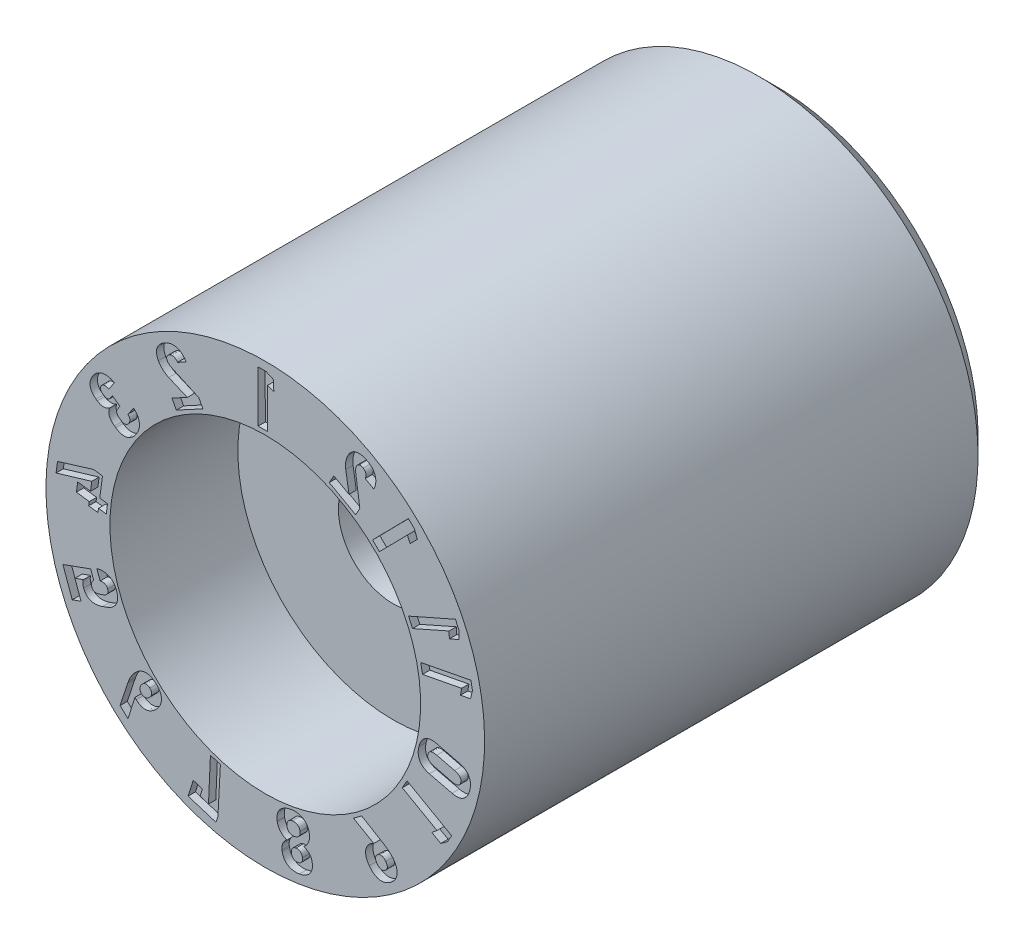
from build123d import *

# Parameters (mm, degrees)
CUT_EXTRUDE1_DEPTH = 0.2


with BuildPart() as part:
    # Sketch1 → Revolve1 (revolve)
    with BuildSketch(Plane(origin=(0, 0, 0), x_dir=(0, 0, -1), z_dir=(1, 0, 0)), mode=Mode.PRIVATE) as revolve1_sk:
        Polygon((14, 1.5), (14, 5.5), (13.5, 6), (0, 6), (0, 4.25), (3.5, 4.25), (3.5, 1.5), align=None)
    revolve(revolve1_sk.sketch.rotate(Axis((0, 0, 0), (0, 0, -1)), 180), axis=Axis((0, 0, 0), (0, 0, -1)))

    # Sketch2 → Cut-Extrude1 (cut)
    # profile 1 of 15: a face of its own
    with BuildSketch(Plane.XY):
        Polygon((-0.197789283, 4.361647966), (0.066563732, 4.363172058), (0.060734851, 5.45638428), (0.232188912, 5.392327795), (0.230736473, 5.673574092), (0.020579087, 5.766859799), (-0.20515278, 5.765581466), align=None)
    # profile 2 of 15: a face of its own
    with BuildSketch(Plane.XY):
        with BuildLine():
            Line((-1.818293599, 4.226114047), (-2.540496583, 4.55327584))
            add(Edge.make_bspline(
                [(-2.540496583, 4.55327584), (-2.570849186, 4.567228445), (-2.607531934, 4.587861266), (-2.643392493, 4.620897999), (-2.66313812, 4.641625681), (-2.675061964, 4.658815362), (-2.681524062, 4.670623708)],
                knots=[0, 0, 0, 0, 0.540031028, 0.66553244, 0.783527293, 1, 1, 1, 1], degree=3))
            Line((-2.681524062, 4.670623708), (-2.682483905, 4.672279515))
            add(Edge.make_bspline(
                [(-2.682483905, 4.672279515), (-2.691000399, 4.687155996), (-2.699210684, 4.711252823), (-2.698842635, 4.744176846), (-2.692586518, 4.767175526), (-2.680864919, 4.788954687), (-2.657016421, 4.817386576), (-2.632502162, 4.833373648), (-2.614935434, 4.842989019)],
                knots=[0, 0, 0, 0, 0.246786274, 0.356909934, 0.46944845, 0.586307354, 0.710253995, 1, 1, 1, 1], degree=3))
            add(Edge.make_bspline(
                [(-2.614935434, 4.842989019), (-2.597313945, 4.85241795), (-2.568802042, 4.862517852), (-2.529364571, 4.862700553), (-2.500878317, 4.856309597), (-2.47339714, 4.843926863), (-2.436703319, 4.81861036), (-2.414141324, 4.791924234), (-2.400526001, 4.772308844)],
                knots=[0, 0, 0, 0, 0.240300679, 0.353786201, 0.468512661, 0.587496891, 0.71289196, 1, 1, 1, 1], degree=3))
            Line((-2.400526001, 4.772308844), (-2.400124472, 4.771361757))
            Line((-2.400124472, 4.771361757), (-2.162339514, 4.899762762))
            Line((-2.162339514, 4.899762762), (-2.162741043, 4.900709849))
            add(Edge.make_bspline(
                [(-2.162741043, 4.900709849), (-2.184602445, 4.935428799), (-2.221196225, 4.983520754), (-2.278910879, 5.036863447), (-2.323937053, 5.068901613), (-2.371113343, 5.094233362), (-2.420103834, 5.112587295), (-2.470846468, 5.122937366), (-2.522762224, 5.126556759), (-2.575604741, 5.122918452), (-2.647953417, 5.107258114), (-2.700403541, 5.085897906), (-2.733995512, 5.067458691)],
                knots=[0, 0, 0, 0, 0.185247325, 0.270908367, 0.35379884, 0.433963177, 0.511943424, 0.589014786, 0.666847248, 0.746166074, 0.827198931, 1, 1, 1, 1], degree=3))
            add(Edge.make_bspline(
                [(-2.733995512, 5.067458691), (-2.769634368, 5.048059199), (-2.819604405, 5.015973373), (-2.876537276, 4.964598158), (-2.910766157, 4.924674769), (-2.938201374, 4.882841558), (-2.958403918, 4.839047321), (-2.971663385, 4.793560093), (-2.976863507, 4.746392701), (-2.975338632, 4.698075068), (-2.962100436, 4.630645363), (-2.941815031, 4.581759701), (-2.924660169, 4.550181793)],
                knots=[0, 0, 0, 0, 0.194582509, 0.283014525, 0.366623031, 0.445927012, 0.521986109, 0.596944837, 0.671952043, 0.748457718, 0.827747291, 1, 1, 1, 1], degree=3))
            Line((-2.924660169, 4.550181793), (-2.92425864, 4.549234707))
            add(Edge.make_bspline(
                [(-2.92425864, 4.549234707), (-2.908886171, 4.521411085), (-2.882739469, 4.480982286), (-2.840349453, 4.432515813), (-2.805656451, 4.398035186), (-2.768167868, 4.366461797), (-2.715035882, 4.329496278), (-2.672571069, 4.306223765), (-2.643023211, 4.293564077)],
                knots=[0, 0, 0, 0, 0.24663637, 0.371530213, 0.498650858, 0.625608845, 0.751024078, 1, 1, 1, 1], degree=3))
            Line((-2.643023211, 4.293564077), (-2.133326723, 4.074760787))
            Line((-2.133326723, 4.074760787), (-2.554003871, 3.847419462))
            Line((-2.554003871, 3.847419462), (-2.433287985, 3.623909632))
            Line((-2.433287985, 3.623909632), (-1.705501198, 4.01703613))
            Line((-1.705501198, 4.01703613), (-1.818293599, 4.226114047))
        make_face()
    # profile 3 of 15: a face of its own
    with BuildSketch(Plane.XY):
        with BuildLine():
            Line((-3.602387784, 3.083039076), (-3.758433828, 2.861259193))
            add(Edge.make_bspline(
                [(-3.758433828, 2.861259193), (-3.748419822, 2.851976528), (-3.734779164, 2.837146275), (-3.720584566, 2.815148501), (-3.712343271, 2.798664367), (-3.707009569, 2.781734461), (-3.703533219, 2.764720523), (-3.702578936, 2.747563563), (-3.703624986, 2.730286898), (-3.707248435, 2.713207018), (-3.715443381, 2.690115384), (-3.724594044, 2.673726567), (-3.732029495, 2.663347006)],
                knots=[0, 0, 0, 0, 0.185668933, 0.271849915, 0.355025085, 0.435165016, 0.512269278, 0.590352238, 0.667877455, 0.746757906, 0.826657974, 1, 1, 1, 1], degree=3))
            add(Edge.make_bspline(
                [(-3.732029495, 2.663347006), (-3.744748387, 2.644964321), (-3.766927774, 2.620306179), (-3.804025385, 2.599855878), (-3.832434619, 2.591770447), (-3.862139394, 2.59033721), (-3.904294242, 2.598172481), (-3.933667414, 2.614184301), (-3.952177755, 2.627114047)],
                knots=[0, 0, 0, 0, 0.265738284, 0.383017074, 0.496928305, 0.612242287, 0.731702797, 1, 1, 1, 1], degree=3))
            Line((-3.952177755, 2.627114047), (-3.978885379, 2.645696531))
            add(Edge.make_bspline(
                [(-3.978885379, 2.645696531), (-3.998098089, 2.659463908), (-4.024807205, 2.681161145), (-4.049615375, 2.716775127), (-4.060927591, 2.742705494), (-4.066432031, 2.769009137), (-4.063886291, 2.805254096), (-4.052075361, 2.830574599), (-4.041164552, 2.845546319)],
                knots=[0, 0, 0, 0, 0.300575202, 0.428718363, 0.545675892, 0.65647807, 0.76535517, 1, 1, 1, 1], degree=3))
            Line((-4.041164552, 2.845546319), (-3.973447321, 2.942110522))
            Line((-3.973447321, 2.942110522), (-4.180536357, 3.087679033))
            Line((-4.180536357, 3.087679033), (-4.248253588, 2.991114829))
            add(Edge.make_bspline(
                [(-4.248253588, 2.991114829), (-4.256623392, 2.978356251), (-4.273519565, 2.962758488), (-4.301382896, 2.951229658), (-4.324119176, 2.948536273), (-4.348413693, 2.951155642), (-4.384258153, 2.961641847), (-4.409757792, 2.976563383), (-4.426423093, 2.988197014)],
                knots=[0, 0, 0, 0, 0.22677833, 0.333313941, 0.445234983, 0.564594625, 0.695766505, 1, 1, 1, 1], degree=3))
            Line((-4.426423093, 2.988197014), (-4.445613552, 3.00190584))
            add(Edge.make_bspline(
                [(-4.445613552, 3.00190584), (-4.461191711, 3.013062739), (-4.482773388, 3.031063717), (-4.501989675, 3.061032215), (-4.510478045, 3.083242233), (-4.513410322, 3.106046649), (-4.51020609, 3.137724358), (-4.499075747, 3.159863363), (-4.489429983, 3.173228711)],
                knots=[0, 0, 0, 0, 0.288124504, 0.41192529, 0.528488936, 0.640572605, 0.752466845, 1, 1, 1, 1], degree=3))
            add(Edge.make_bspline(
                [(-4.489429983, 3.173228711), (-4.482824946, 3.182610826), (-4.47134178, 3.195685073), (-4.452365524, 3.208401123), (-4.437372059, 3.216498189), (-4.420836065, 3.221796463), (-4.403482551, 3.225991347), (-4.384892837, 3.226740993), (-4.365536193, 3.226285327), (-4.345341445, 3.223375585), (-4.316510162, 3.216628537), (-4.295258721, 3.208021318), (-4.281005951, 3.201599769)],
                knots=[0, 0, 0, 0, 0.150327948, 0.223514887, 0.297445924, 0.371958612, 0.449582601, 0.529747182, 0.613908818, 0.702218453, 0.795553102, 1, 1, 1, 1], degree=3))
            Line((-4.281005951, 3.201599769), (-4.125668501, 3.422821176))
            add(Edge.make_bspline(
                [(-4.125668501, 3.422821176), (-4.160671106, 3.442797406), (-4.214726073, 3.467958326), (-4.289921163, 3.487213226), (-4.344493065, 3.494145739), (-4.397880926, 3.493985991), (-4.44973917, 3.487595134), (-4.499414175, 3.473469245), (-4.546846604, 3.452966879), (-4.591674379, 3.426546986), (-4.647732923, 3.382744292), (-4.683195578, 3.341933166), (-4.703851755, 3.312213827)],
                knots=[0, 0, 0, 0, 0.185402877, 0.271954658, 0.355808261, 0.437510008, 0.51672484, 0.595164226, 0.673981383, 0.753613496, 0.833638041, 1, 1, 1, 1], degree=3))
            add(Edge.make_bspline(
                [(-4.703851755, 3.312213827), (-4.720542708, 3.288235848), (-4.743205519, 3.251896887), (-4.766447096, 3.201469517), (-4.779391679, 3.165075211), (-4.788296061, 3.12902815), (-4.793555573, 3.093395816), (-4.794670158, 3.058203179), (-4.791569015, 3.023659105), (-4.784971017, 2.989853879), (-4.774390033, 2.957116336), (-4.759859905, 2.925537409), (-4.741663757, 2.895005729), (-4.719101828, 2.866075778), (-4.683560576, 2.827708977), (-4.652078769, 2.802617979), (-4.629793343, 2.786671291)],
                knots=[0, 0, 0, 0, 0.145221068, 0.21203939, 0.275497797, 0.336822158, 0.396212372, 0.454116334, 0.511300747, 0.568162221, 0.624888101, 0.681779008, 0.74052302, 0.801035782, 0.86369242, 1, 1, 1, 1], degree=3))
            Line((-4.629793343, 2.786671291), (-4.595278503, 2.762409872))
            add(Edge.make_bspline(
                [(-4.595278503, 2.762409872), (-4.570307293, 2.745071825), (-4.53033843, 2.723037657), (-4.472476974, 2.708670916), (-4.429300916, 2.704263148), (-4.385954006, 2.707139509), (-4.327635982, 2.720146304), (-4.286804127, 2.740831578), (-4.261153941, 2.757514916)],
                knots=[0, 0, 0, 0, 0.256538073, 0.378140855, 0.499461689, 0.620240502, 0.742003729, 1, 1, 1, 1], degree=3))
            add(Edge.make_bspline(
                [(-4.261153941, 2.757514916), (-4.267756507, 2.742273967), (-4.274899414, 2.718563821), (-4.280034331, 2.686390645), (-4.282001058, 2.662679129), (-4.281102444, 2.639059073), (-4.277721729, 2.615662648), (-4.272429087, 2.592216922), (-4.264612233, 2.569034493), (-4.254562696, 2.54616059), (-4.242205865, 2.523970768), (-4.228087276, 2.50223551), (-4.211524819, 2.481292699), (-4.192991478, 2.460766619), (-4.164606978, 2.433782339), (-4.140802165, 2.415630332), (-4.124340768, 2.403774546)],
                knots=[0, 0, 0, 0, 0.120514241, 0.178963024, 0.236485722, 0.293075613, 0.350257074, 0.408015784, 0.467448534, 0.527698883, 0.589261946, 0.6517676, 0.715782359, 0.78301219, 0.852531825, 1, 1, 1, 1], degree=3))
            Line((-4.124340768, 2.403774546), (-4.089825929, 2.379513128))
            add(Edge.make_bspline(
                [(-4.089825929, 2.379513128), (-4.058900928, 2.35757636), (-4.010446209, 2.32984393), (-3.941973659, 2.306958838), (-3.892460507, 2.29774944), (-3.843513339, 2.295847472), (-3.795487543, 2.30232439), (-3.748439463, 2.315845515), (-3.702745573, 2.337049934), (-3.658621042, 2.36565371), (-3.600551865, 2.414963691), (-3.56291886, 2.460411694), (-3.53978661, 2.493326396)],
                knots=[0, 0, 0, 0, 0.178207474, 0.259966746, 0.33803101, 0.414007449, 0.489004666, 0.564650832, 0.643103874, 0.724692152, 0.81089971, 1, 1, 1, 1], degree=3))
            add(Edge.make_bspline(
                [(-3.53978661, 2.493326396), (-3.516564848, 2.526033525), (-3.486909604, 2.577342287), (-3.459961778, 2.649890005), (-3.447043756, 2.70338819), (-3.440678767, 2.756651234), (-3.442254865, 2.809165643), (-3.450606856, 2.860598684), (-3.466173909, 2.910750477), (-3.489294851, 2.958707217), (-3.530787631, 3.020332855), (-3.572153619, 3.059472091), (-3.602387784, 3.083039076)],
                knots=[0, 0, 0, 0, 0.181513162, 0.266410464, 0.349351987, 0.429979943, 0.508354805, 0.586249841, 0.66506638, 0.74508699, 0.826277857, 1, 1, 1, 1], degree=3))
        make_face()
    # profile 4 of 15: a face of its own
    with BuildSketch(Plane.XY):
        Polygon((-4.69377454, 1.085606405), (-5.68439717, 0.783595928), (-5.724131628, 0.487990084), (-4.746612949, 0.779988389), (-4.780502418, 0.527004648), (-5.131814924, 0.574197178), (-5.166887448, 0.312815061), (-4.815517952, 0.265614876), (-4.830064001, 0.157029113), (-4.578413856, 0.123149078), (-4.563824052, 0.231804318), (-4.350243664, 0.203113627), (-4.31517114, 0.464495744), (-4.528727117, 0.493183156), (-4.453507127, 1.053372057), align=None)
    # profile 5 of 15: a face of its own
    with BuildSketch(Plane.XY):
        with BuildLine():
            Line((-4.607096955, -1.217617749), (-4.51827577, -1.467169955))
            add(Edge.make_bspline(
                [(-4.51827577, -1.467169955), (-4.494689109, -1.460592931), (-4.460693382, -1.456420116), (-4.416873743, -1.46065281), (-4.388272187, -1.469579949), (-4.362841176, -1.483266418), (-4.334063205, -1.509184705), (-4.319061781, -1.534600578), (-4.312754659, -1.553269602)],
                knots=[0, 0, 0, 0, 0.286425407, 0.412421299, 0.532755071, 0.648554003, 0.760968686, 1, 1, 1, 1], degree=3))
            add(Edge.make_bspline(
                [(-4.312754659, -1.553269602), (-4.305579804, -1.572893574), (-4.299449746, -1.603801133), (-4.306280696, -1.643855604), (-4.318395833, -1.67074686), (-4.336852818, -1.69504319), (-4.370910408, -1.725742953), (-4.404185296, -1.740282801), (-4.427112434, -1.749173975)],
                knots=[0, 0, 0, 0, 0.244767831, 0.357262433, 0.468878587, 0.585370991, 0.710838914, 1, 1, 1, 1], degree=3))
            Line((-4.427112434, -1.749173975), (-4.537982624, -1.789149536))
            add(Edge.make_bspline(
                [(-4.537982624, -1.789149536), (-4.561091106, -1.797817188), (-4.595556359, -1.806431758), (-4.640640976, -1.807093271), (-4.669461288, -1.801238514), (-4.694992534, -1.790409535), (-4.724252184, -1.767548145), (-4.738164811, -1.742616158), (-4.744610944, -1.725035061)],
                knots=[0, 0, 0, 0, 0.302892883, 0.431392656, 0.550040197, 0.661203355, 0.768793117, 1, 1, 1, 1], degree=3))
            add(Edge.make_bspline(
                [(-4.744610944, -1.725035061), (-4.750667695, -1.708295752), (-4.75664625, -1.682503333), (-4.755943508, -1.647980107), (-4.751158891, -1.623693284), (-4.742372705, -1.600678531), (-4.725203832, -1.571910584), (-4.706760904, -1.554097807), (-4.692912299, -1.544165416)],
                knots=[0, 0, 0, 0, 0.263348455, 0.385871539, 0.507659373, 0.627206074, 0.748082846, 1, 1, 1, 1], degree=3))
            Line((-4.692912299, -1.544165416), (-4.776675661, -1.311518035))
            Line((-4.776675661, -1.311518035), (-5.53654919, -1.585006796))
            Line((-5.53654919, -1.585006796), (-5.280941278, -2.2949181))
            Line((-5.280941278, -2.2949181), (-5.040936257, -2.20841889))
            Line((-5.040936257, -2.20841889), (-5.206881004, -1.747735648))
            Line((-5.206881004, -1.747735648), (-4.973391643, -1.663648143))
            add(Edge.make_bspline(
                [(-4.973391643, -1.663648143), (-4.979449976, -1.677003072), (-4.985461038, -1.699039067), (-4.988961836, -1.730295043), (-4.989084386, -1.756109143), (-4.987249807, -1.782562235), (-4.982293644, -1.817197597), (-4.975641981, -1.84237532), (-4.969897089, -1.858556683)],
                knots=[0, 0, 0, 0, 0.220311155, 0.341953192, 0.473174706, 0.6088078, 0.74130697, 1, 1, 1, 1], degree=3))
            add(Edge.make_bspline(
                [(-4.969897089, -1.858556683), (-4.958581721, -1.890697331), (-4.936219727, -1.935901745), (-4.894949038, -1.986898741), (-4.86019654, -2.018287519), (-4.821134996, -2.04359536), (-4.77784778, -2.062244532), (-4.730774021, -2.074384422), (-4.680004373, -2.080094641), (-4.626069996, -2.079481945), (-4.54731013, -2.069520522), (-4.488148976, -2.052524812), (-4.448319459, -2.038377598)],
                knots=[0, 0, 0, 0, 0.163572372, 0.239328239, 0.313612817, 0.387362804, 0.461652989, 0.538788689, 0.619799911, 0.706109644, 0.797006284, 1, 1, 1, 1], degree=3))
            Line((-4.448319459, -2.038377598), (-4.337449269, -1.998402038))
            add(Edge.make_bspline(
                [(-4.337449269, -1.998402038), (-4.297444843, -1.984455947), (-4.241320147, -1.958171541), (-4.175239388, -1.912692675), (-4.134539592, -1.874994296), (-4.100554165, -1.833931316), (-4.074147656, -1.789239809), (-4.054609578, -1.741444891), (-4.042923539, -1.690305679), (-4.038683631, -1.63640926), (-4.043106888, -1.558858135), (-4.058987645, -1.500906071), (-4.072323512, -1.462352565)],
                knots=[0, 0, 0, 0, 0.186940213, 0.272022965, 0.353192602, 0.431092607, 0.506534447, 0.581498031, 0.658173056, 0.737158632, 0.819460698, 1, 1, 1, 1], degree=3))
            add(Edge.make_bspline(
                [(-4.072323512, -1.462352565), (-4.084046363, -1.428129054), (-4.108525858, -1.380361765), (-4.150649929, -1.323582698), (-4.187145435, -1.287095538), (-4.22800539, -1.255919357), (-4.272899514, -1.230866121), (-4.321556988, -1.21178423), (-4.373827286, -1.199378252), (-4.429157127, -1.193558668), (-4.50807175, -1.194675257), (-4.567620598, -1.206304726), (-4.607096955, -1.217617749)],
                knots=[0, 0, 0, 0, 0.165262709, 0.244174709, 0.322923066, 0.400784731, 0.478837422, 0.557608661, 0.639405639, 0.724105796, 0.81178613, 1, 1, 1, 1], degree=3))
        make_face()
    # profile 6 of 15: a face of its own
    with BuildSketch(Plane.XY):
        with BuildLine():
            Line((-3.764542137, -3.514787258), (-3.973189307, -4.145807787))
            Line((-3.973189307, -4.145807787), (-3.756859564, -4.350843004))
            Line((-3.756859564, -4.350843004), (-3.563809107, -3.74675713))
            add(Edge.make_bspline(
                [(-3.563809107, -3.74675713), (-3.553912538, -3.760667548), (-3.542386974, -3.773421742), (-3.530054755, -3.785180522)],
                knots=[0.758677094, 0.758677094, 0.758677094, 0.758677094, 1, 1, 1, 1], degree=3))
            add(Edge.make_bspline(
                [(-3.530054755, -3.785180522), (-3.504116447, -3.810114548), (-3.462168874, -3.842372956), (-3.400317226, -3.872136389), (-3.354127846, -3.886167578), (-3.307071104, -3.893270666), (-3.259481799, -3.892038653), (-3.211645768, -3.883894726), (-3.163902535, -3.867946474), (-3.116204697, -3.845175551), (-3.051660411, -3.802910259), (-3.006841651, -3.763437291), (-2.97904452, -3.733339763)],
                knots=[0, 0, 0, 0, 0.171862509, 0.250291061, 0.32656686, 0.401554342, 0.47651707, 0.552895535, 0.632432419, 0.716093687, 0.80458129, 1, 1, 1, 1], degree=3))
            add(Edge.make_bspline(
                [(-2.97904452, -3.733339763), (-2.949407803, -3.70265089), (-2.911219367, -3.654584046), (-2.873337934, -3.584851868), (-2.853668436, -3.533537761), (-2.841710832, -3.48208586), (-2.837873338, -3.430719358), (-2.842197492, -3.379737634), (-2.854674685, -3.329455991), (-2.874821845, -3.280092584), (-2.913306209, -3.213972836), (-2.952234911, -3.169466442), (-2.981510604, -3.141840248)],
                knots=[0, 0, 0, 0, 0.186979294, 0.272364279, 0.353583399, 0.431716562, 0.507485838, 0.58271972, 0.659285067, 0.738013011, 0.8200875, 1, 1, 1, 1], degree=3))
            add(Edge.make_bspline(
                [(-2.981510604, -3.141840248), (-3.010547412, -3.114279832), (-3.056750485, -3.077770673), (-3.124443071, -3.042537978), (-3.174663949, -3.024845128), (-3.225347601, -3.015259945), (-3.276114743, -3.013428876), (-3.32684216, -3.019567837), (-3.377392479, -3.033346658), (-3.427127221, -3.055386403), (-3.49432846, -3.096164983), (-3.5394467, -3.137030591), (-3.568153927, -3.166914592)],
                knots=[0, 0, 0, 0, 0.180127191, 0.262705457, 0.342107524, 0.418644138, 0.493745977, 0.569602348, 0.647518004, 0.728441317, 0.813380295, 1, 1, 1, 1], degree=3))
            add(Edge.make_bspline(
                [(-3.568153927, -3.166914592), (-3.586760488, -3.186400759), (-3.612178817, -3.217109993), (-3.643344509, -3.261133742), (-3.690178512, -3.334663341), (-3.721798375, -3.40139848), (-3.743486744, -3.456589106)],
                knots=[0, 0, 0, 0, 0.230619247, 0.351394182, 0.476038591, 1, 1, 1, 1], degree=3))
            add(Edge.make_bspline(
                [(-3.743486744, -3.456589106), (-3.74731118, -3.46628495), (-3.75533677, -3.485330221), (-3.761194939, -3.505146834), (-3.764542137, -3.514787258)],
                knots=[0, 0, 0, 0, 0.505360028, 1, 1, 1, 1], degree=3))
        make_face()
        with BuildLine():
            Line((-3.157954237, -3.539554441), (-3.158765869, -3.540452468))
            add(Edge.make_bspline(
                [(-3.158765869, -3.540452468), (-3.176638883, -3.558829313), (-3.204363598, -3.583698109), (-3.246842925, -3.604345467), (-3.277068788, -3.611799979), (-3.306991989, -3.612257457), (-3.346933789, -3.602970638), (-3.37307914, -3.58481069), (-3.388363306, -3.570337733)],
                knots=[0, 0, 0, 0, 0.294328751, 0.419071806, 0.536316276, 0.647265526, 0.758044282, 1, 1, 1, 1], degree=3))
            add(Edge.make_bspline(
                [(-3.388363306, -3.570337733), (-3.404108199, -3.556308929), (-3.422291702, -3.53070194), (-3.434012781, -3.491521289), (-3.434297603, -3.461407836), (-3.427841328, -3.430715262), (-3.409420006, -3.387201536), (-3.386427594, -3.357942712), (-3.368895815, -3.339389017)],
                knots=[0, 0, 0, 0, 0.240144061, 0.350681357, 0.462748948, 0.580659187, 0.707140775, 1, 1, 1, 1], degree=3))
            add(Edge.make_bspline(
                [(-3.368895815, -3.339389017), (-3.353025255, -3.322585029), (-3.327989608, -3.301635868), (-3.289870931, -3.285036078), (-3.262011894, -3.279969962), (-3.234215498, -3.28202118), (-3.196054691, -3.292782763), (-3.171434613, -3.311909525), (-3.156187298, -3.325783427)],
                knots=[0, 0, 0, 0, 0.277582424, 0.398175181, 0.512354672, 0.625221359, 0.741294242, 1, 1, 1, 1], degree=3))
            add(Edge.make_bspline(
                [(-3.156187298, -3.325783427), (-3.140901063, -3.340160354), (-3.121101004, -3.364223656), (-3.10753132, -3.40179025), (-3.10477251, -3.429752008), (-3.108326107, -3.458026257), (-3.12243896, -3.497446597), (-3.142679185, -3.523337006), (-3.157954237, -3.539554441)],
                knots=[0, 0, 0, 0, 0.260003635, 0.375027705, 0.487763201, 0.603252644, 0.723685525, 1, 1, 1, 1], degree=3))
        make_face(mode=Mode.SUBTRACT)
    # profile 7 of 15: a face of its own
    with BuildSketch(Plane.XY):
        Polygon((-1.295226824, -5.433053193), (-1.227797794, -4.170593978), (-1.500745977, -4.085051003), (-1.553577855, -5.269311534), (-1.782967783, -5.197139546), (-1.71995233, -4.99580703), (-1.971834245, -4.916973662), (-2.11102816, -5.360906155), (-1.347689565, -5.600343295), align=None)
    # profile 8 of 15: a face of its own
    with BuildSketch(Plane.XY):
        with BuildLine():
            Line((0.325136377, -4.725408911), (0.328907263, -4.748223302))
            add(Edge.make_bspline(
                [(0.328907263, -4.748223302), (0.334365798, -4.782241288), (0.349955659, -4.832237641), (0.384694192, -4.892895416), (0.417183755, -4.93510184), (0.455059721, -4.97277418), (0.511366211, -5.015529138), (0.559969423, -5.037223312), (0.593478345, -5.047470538)],
                knots=[0, 0, 0, 0, 0.245718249, 0.369513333, 0.497226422, 0.624713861, 0.74971991, 1, 1, 1, 1], degree=3))
            add(Edge.make_bspline(
                [(0.593478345, -5.047470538), (0.569198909, -5.064943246), (0.535516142, -5.095219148), (0.500680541, -5.143899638), (0.479537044, -5.183094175), (0.464333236, -5.224256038), (0.451735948, -5.279896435), (0.452639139, -5.32264326), (0.457022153, -5.350234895)],
                knots=[0, 0, 0, 0, 0.257021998, 0.384551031, 0.51217146, 0.63812076, 0.76004896, 1, 1, 1, 1], degree=3))
            Line((0.457022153, -5.350234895), (0.462910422, -5.386485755))
            add(Edge.make_bspline(
                [(0.462910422, -5.386485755), (0.46865663, -5.420749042), (0.482465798, -5.470934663), (0.515050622, -5.530550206), (0.544225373, -5.570298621), (0.579326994, -5.604306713), (0.618470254, -5.633868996), (0.662705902, -5.656971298), (0.71070847, -5.674990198), (0.762480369, -5.686783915), (0.83743033, -5.69389648), (0.895126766, -5.689874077), (0.93381258, -5.683369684)],
                knots=[0, 0, 0, 0, 0.166755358, 0.246297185, 0.32438274, 0.402008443, 0.479602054, 0.55855855, 0.640168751, 0.724632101, 0.812104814, 1, 1, 1, 1], degree=3))
            add(Edge.make_bspline(
                [(0.93381258, -5.683369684), (0.972381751, -5.67667099), (1.028688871, -5.663022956), (1.097201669, -5.631673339), (1.142530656, -5.603915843), (1.182236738, -5.571397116), (1.21683184, -5.535558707), (1.244571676, -5.495201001), (1.266605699, -5.451593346), (1.281758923, -5.404753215), (1.293740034, -5.337870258), (1.290833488, -5.285968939), (1.285133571, -5.25163322)],
                knots=[0, 0, 0, 0, 0.187908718, 0.275416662, 0.360083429, 0.441840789, 0.520724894, 0.597915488, 0.675567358, 0.754033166, 0.832947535, 1, 1, 1, 1], degree=3))
            Line((1.285133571, -5.25163322), (1.279245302, -5.21538236))
            add(Edge.make_bspline(
                [(1.279245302, -5.21538236), (1.274671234, -5.187306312), (1.261360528, -5.146180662), (1.231257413, -5.096976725), (1.202893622, -5.063229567), (1.170302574, -5.032782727), (1.121160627, -4.998349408), (1.079460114, -4.980611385), (1.050489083, -4.972411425)],
                knots=[0, 0, 0, 0, 0.242452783, 0.36386828, 0.489952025, 0.617354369, 0.743250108, 1, 1, 1, 1], degree=3))
            add(Edge.make_bspline(
                [(1.050489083, -4.972411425), (1.079647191, -4.952118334), (1.118403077, -4.915207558), (1.159048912, -4.856850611), (1.182939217, -4.809026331), (1.200967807, -4.758904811), (1.2146699, -4.690279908), (1.213882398, -4.637881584), (1.208120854, -4.603808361)],
                knots=[0, 0, 0, 0, 0.252158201, 0.376883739, 0.504107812, 0.63129592, 0.754621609, 1, 1, 1, 1], degree=3))
            Line((1.208120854, -4.603808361), (1.204349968, -4.58099397))
            add(Edge.make_bspline(
                [(1.204349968, -4.58099397), (1.19807011, -4.544626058), (1.183740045, -4.491346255), (1.149035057, -4.428167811), (1.117860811, -4.386409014), (1.080966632, -4.349871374), (1.038800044, -4.319305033), (0.991719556, -4.294667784), (0.940132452, -4.27631133), (0.884744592, -4.263930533), (0.80453475, -4.256434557), (0.74284993, -4.260794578), (0.701457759, -4.267790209)],
                knots=[0, 0, 0, 0, 0.16647075, 0.245115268, 0.323050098, 0.400163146, 0.477804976, 0.556487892, 0.63841142, 0.723457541, 0.811169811, 1, 1, 1, 1], degree=3))
            add(Edge.make_bspline(
                [(0.701457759, -4.267790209), (0.660116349, -4.274758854), (0.599931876, -4.289565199), (0.526648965, -4.323058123), (0.477950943, -4.352168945), (0.435113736, -4.386113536), (0.398334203, -4.424274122), (0.368469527, -4.466877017), (0.344971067, -4.513249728), (0.328465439, -4.562779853), (0.316386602, -4.633881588), (0.319146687, -4.688861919), (0.325136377, -4.725408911)],
                knots=[0, 0, 0, 0, 0.188911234, 0.27665744, 0.361678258, 0.443562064, 0.521838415, 0.599287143, 0.67674178, 0.75495613, 0.833257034, 1, 1, 1, 1], degree=3))
        make_face()
        with BuildLine():
            Line((0.949184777, -4.661823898), (0.95157254, -4.675169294))
            add(Edge.make_bspline(
                [(0.95157254, -4.675169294), (0.954069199, -4.689979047), (0.955000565, -4.712364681), (0.949984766, -4.741256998), (0.943197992, -4.761450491), (0.933266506, -4.780076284), (0.92142134, -4.797619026), (0.906435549, -4.813173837), (0.889176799, -4.827082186), (0.869671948, -4.839126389), (0.839918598, -4.85224738), (0.815782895, -4.858636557), (0.798960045, -4.861146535)],
                knots=[0, 0, 0, 0, 0.166565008, 0.245859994, 0.324124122, 0.401702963, 0.479331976, 0.558127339, 0.640220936, 0.724652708, 0.811551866, 1, 1, 1, 1], degree=3))
            add(Edge.make_bspline(
                [(0.798960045, -4.861146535), (0.782179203, -4.863708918), (0.757233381, -4.866179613), (0.724787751, -4.862832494), (0.702385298, -4.85790535), (0.68152969, -4.850091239), (0.662644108, -4.839678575), (0.645248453, -4.827469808), (0.630321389, -4.812341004), (0.617279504, -4.795435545), (0.60323051, -4.769524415), (0.597314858, -4.747861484), (0.594744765, -4.73304167)],
                knots=[0, 0, 0, 0, 0.188246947, 0.274866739, 0.359835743, 0.44132157, 0.520220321, 0.597868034, 0.675487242, 0.75432286, 0.833354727, 1, 1, 1, 1], degree=3))
            Line((0.594744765, -4.73304167), (0.592354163, -4.71879406))
            add(Edge.make_bspline(
                [(0.592354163, -4.71879406), (0.589653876, -4.702843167), (0.588529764, -4.678816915), (0.593027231, -4.647669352), (0.599807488, -4.625955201), (0.609180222, -4.605700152), (0.6210272, -4.586925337), (0.636084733, -4.570466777), (0.653241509, -4.555549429), (0.672994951, -4.543060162), (0.702141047, -4.528491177), (0.726443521, -4.522494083), (0.742940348, -4.51965073)],
                knots=[0, 0, 0, 0, 0.17278034, 0.255068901, 0.335187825, 0.415003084, 0.493110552, 0.571409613, 0.652579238, 0.735418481, 0.820528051, 1, 1, 1, 1], degree=3))
            add(Edge.make_bspline(
                [(0.742940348, -4.51965073), (0.759488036, -4.516730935), (0.784423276, -4.515198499), (0.816732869, -4.519529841), (0.83928834, -4.525478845), (0.860408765, -4.534165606), (0.879945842, -4.545193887), (0.897192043, -4.55950511), (0.912600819, -4.575823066), (0.925895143, -4.594417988), (0.940241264, -4.622544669), (0.946404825, -4.645878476), (0.949184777, -4.661823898)],
                knots=[0, 0, 0, 0, 0.179082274, 0.263835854, 0.346472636, 0.426936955, 0.506638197, 0.584521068, 0.664787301, 0.745258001, 0.827239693, 1, 1, 1, 1], degree=3))
        make_face(mode=Mode.SUBTRACT)
        with BuildLine():
            Line((1.01616837, -5.247697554), (1.018285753, -5.261134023))
            add(Edge.make_bspline(
                [(1.018285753, -5.261134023), (1.020590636, -5.274890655), (1.021847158, -5.29554196), (1.017868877, -5.322221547), (1.012823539, -5.340885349), (1.005052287, -5.358200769), (0.995217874, -5.374135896), (0.982824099, -5.388277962), (0.968442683, -5.400869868), (0.952202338, -5.412001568), (0.926998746, -5.423261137), (0.90690234, -5.429641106), (0.892600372, -5.431418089)],
                knots=[0, 0, 0, 0, 0.175700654, 0.257572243, 0.338547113, 0.418148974, 0.495516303, 0.573289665, 0.653732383, 0.735586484, 0.819887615, 1, 1, 1, 1], degree=3))
            add(Edge.make_bspline(
                [(0.892600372, -5.431418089), (0.878467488, -5.433186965), (0.857307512, -5.435444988), (0.829968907, -5.431474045), (0.810835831, -5.426954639), (0.792974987, -5.419756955), (0.776835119, -5.409793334), (0.762223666, -5.397824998), (0.749222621, -5.383691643), (0.738386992, -5.367426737), (0.726569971, -5.342917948), (0.720793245, -5.322955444), (0.718627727, -5.309082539)],
                knots=[0, 0, 0, 0, 0.179176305, 0.26272206, 0.344581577, 0.424728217, 0.502426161, 0.581002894, 0.660377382, 0.741777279, 0.824574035, 1, 1, 1, 1], degree=3))
            Line((0.718627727, -5.309082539), (0.716237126, -5.294834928))
            add(Edge.make_bspline(
                [(0.716237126, -5.294834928), (0.713841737, -5.280383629), (0.712697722, -5.258749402), (0.715628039, -5.230518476), (0.720999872, -5.210836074), (0.728419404, -5.192405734), (0.738478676, -5.175576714), (0.750433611, -5.160289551), (0.764916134, -5.146996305), (0.781169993, -5.13550797), (0.805781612, -5.122584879), (0.826400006, -5.117289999), (0.840448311, -5.114811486)],
                knots=[0, 0, 0, 0, 0.178388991, 0.262964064, 0.344995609, 0.426393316, 0.504518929, 0.583338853, 0.662244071, 0.743343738, 0.825530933, 1, 1, 1, 1], degree=3))
            add(Edge.make_bspline(
                [(0.840448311, -5.114811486), (0.854595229, -5.112920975), (0.875918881, -5.110856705), (0.903378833, -5.115471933), (0.922557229, -5.121005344), (0.940426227, -5.129196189), (0.956790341, -5.139802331), (0.971502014, -5.152812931), (0.984445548, -5.168146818), (0.995680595, -5.185390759), (1.008145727, -5.211497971), (1.013767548, -5.232921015), (1.01616837, -5.247697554)],
                knots=[0, 0, 0, 0, 0.173582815, 0.255391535, 0.33549223, 0.414428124, 0.492215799, 0.570545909, 0.651074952, 0.734215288, 0.81882278, 1, 1, 1, 1], degree=3))
        make_face(mode=Mode.SUBTRACT)
    # profile 9 of 15: a face of its own
    with BuildSketch(Plane.XY):
        with BuildLine():
            Line((2.843421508, -4.530222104), (2.844072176, -4.531018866))
            add(Edge.make_bspline(
                [(2.844072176, -4.531018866), (2.869278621, -4.564844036), (2.909777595, -4.61180553), (2.972410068, -4.661723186), (3.019669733, -4.690615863), (3.068579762, -4.711513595), (3.118829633, -4.724180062), (3.170024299, -4.729203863), (3.222044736, -4.72564096), (3.274368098, -4.714399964), (3.346409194, -4.687500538), (3.397304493, -4.656968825), (3.429757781, -4.6327058)],
                knots=[0, 0, 0, 0, 0.187452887, 0.273103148, 0.354468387, 0.432526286, 0.508156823, 0.583550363, 0.659808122, 0.738584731, 0.820197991, 1, 1, 1, 1], degree=3))
            add(Edge.make_bspline(
                [(3.429757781, -4.6327058), (3.462213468, -4.608783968), (3.506482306, -4.569422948), (3.552981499, -4.508322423), (3.578911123, -4.461280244), (3.597119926, -4.412214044), (3.607164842, -4.361462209), (3.609617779, -4.309439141), (3.603777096, -4.256128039), (3.590006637, -4.202020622), (3.56032717, -4.126863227), (3.527525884, -4.073687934), (3.502116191, -4.039504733)],
                knots=[0, 0, 0, 0, 0.17825688, 0.259594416, 0.338119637, 0.414699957, 0.489865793, 0.565781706, 0.64389787, 0.725894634, 0.811718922, 1, 1, 1, 1], degree=3))
            add(Edge.make_bspline(
                [(3.502116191, -4.039504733), (3.48722343, -4.019213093), (3.462574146, -3.990627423), (3.425758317, -3.954872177), (3.394631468, -3.928047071), (3.360893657, -3.901279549), (3.311278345, -3.864500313), (3.271636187, -3.838387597), (3.244584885, -3.820728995)],
                knots=[0, 0, 0, 0, 0.21694703, 0.333215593, 0.453749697, 0.580299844, 0.714145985, 1, 1, 1, 1], degree=3))
            add(Edge.make_bspline(
                [(3.244584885, -3.820728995), (3.236631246, -3.815390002), (3.220424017, -3.805367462), (3.204396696, -3.795030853), (3.195862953, -3.790841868)],
                knots=[0, 0, 0, 0, 0.502405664, 1, 1, 1, 1], degree=3))
            Line((3.195862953, -3.790841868), (2.637033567, -3.455949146))
            Line((2.637033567, -3.455949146), (2.41202314, -3.622027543))
            Line((2.41202314, -3.622027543), (2.968833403, -3.942881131))
            add(Edge.make_bspline(
                [(2.968833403, -3.942881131), (2.967626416, -3.943292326), (2.957449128, -3.946865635), (2.92853925, -3.959729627), (2.902768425, -3.975844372), (2.886040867, -3.988176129)],
                knots=[0.564365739, 0.564365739, 0.564365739, 0.564365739, 0.581964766, 0.713240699, 1, 1, 1, 1], degree=3))
            add(Edge.make_bspline(
                [(2.886040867, -3.988176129), (2.858894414, -4.008063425), (2.822193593, -4.042224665), (2.785228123, -4.096548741), (2.764903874, -4.139745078), (2.750915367, -4.185197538), (2.74356203, -4.232464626), (2.743630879, -4.2812965), (2.750034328, -4.331270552), (2.76347488, -4.381804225), (2.790687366, -4.45069629), (2.820546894, -4.499207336), (2.843421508, -4.530222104)],
                knots=[0, 0, 0, 0, 0.165212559, 0.243295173, 0.321098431, 0.398558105, 0.475899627, 0.554875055, 0.637363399, 0.722438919, 0.810762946, 1, 1, 1, 1], degree=3))
        make_face()
        with BuildLine():
            Line((3.296424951, -4.205845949), (3.296991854, -4.206915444))
            add(Edge.make_bspline(
                [(3.296991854, -4.206915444), (3.311295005, -4.225707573), (3.328115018, -4.255567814), (3.339167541, -4.297978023), (3.339752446, -4.327494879), (3.334028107, -4.355792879), (3.316228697, -4.391846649), (3.294426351, -4.414056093), (3.277386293, -4.426231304)],
                knots=[0, 0, 0, 0, 0.283319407, 0.405630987, 0.522186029, 0.634485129, 0.748744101, 1, 1, 1, 1], degree=3))
            add(Edge.make_bspline(
                [(3.277386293, -4.426231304), (3.26042015, -4.438540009), (3.2328653, -4.454119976), (3.192724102, -4.459459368), (3.163946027, -4.456788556), (3.135884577, -4.447094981), (3.098405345, -4.424039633), (3.074745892, -4.398845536), (3.061035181, -4.379481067)],
                knots=[0, 0, 0, 0, 0.252248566, 0.365947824, 0.478303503, 0.594066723, 0.716780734, 1, 1, 1, 1], degree=3))
            Line((3.061035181, -4.379481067), (3.060384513, -4.378684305))
            add(Edge.make_bspline(
                [(3.060384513, -4.378684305), (3.046008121, -4.359030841), (3.027378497, -4.328594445), (3.016296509, -4.284777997), (3.015066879, -4.254608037), (3.020439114, -4.225810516), (3.037405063, -4.188833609), (3.059913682, -4.166689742), (3.076799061, -4.154209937)],
                knots=[0, 0, 0, 0, 0.287505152, 0.411241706, 0.527095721, 0.639456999, 0.752084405, 1, 1, 1, 1], degree=3))
            add(Edge.make_bspline(
                [(3.076799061, -4.154209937), (3.093403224, -4.141427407), (3.121315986, -4.127149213), (3.1616214, -4.121980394), (3.190860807, -4.12579796), (3.219624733, -4.13570442), (3.257784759, -4.160178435), (3.282123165, -4.185923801), (3.296424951, -4.205845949)],
                knots=[0, 0, 0, 0, 0.246066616, 0.358457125, 0.471834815, 0.589083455, 0.712499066, 1, 1, 1, 1], degree=3))
        make_face(mode=Mode.SUBTRACT)
    # profile 10 of 15: a face of its own
    with BuildSketch(Plane.XY):
        Polygon((3.879111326, -2.003586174), (3.748785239, -2.232844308), (4.697677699, -2.771352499), (4.557304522, -2.887998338), (4.801368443, -3.026434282), (4.986802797, -2.891208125), (5.098111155, -2.695224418), align=None)
    # profile 11 of 15: a face of its own
    with BuildSketch(Plane.XY):
        with BuildLine():
            Line((4.489173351, -1.531152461), (5.107834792, -1.682770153))
            add(Edge.make_bspline(
                [(5.107834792, -1.682770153), (5.13680349, -1.689794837), (5.179932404, -1.697435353), (5.236831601, -1.699589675), (5.276735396, -1.697615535), (5.314906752, -1.691265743), (5.351299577, -1.681132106), (5.385935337, -1.666963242), (5.418749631, -1.649006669), (5.449474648, -1.627242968), (5.477641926, -1.601578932), (5.503521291, -1.572362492), (5.526761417, -1.539256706), (5.547357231, -1.502376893), (5.572655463, -1.446885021), (5.586446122, -1.401836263), (5.594016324, -1.370589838)],
                knots=[0, 0, 0, 0, 0.13593331, 0.198749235, 0.259181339, 0.317692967, 0.374726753, 0.430999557, 0.487858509, 0.544847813, 0.602170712, 0.661142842, 0.72237782, 0.786127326, 0.853396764, 1, 1, 1, 1], degree=3))
            add(Edge.make_bspline(
                [(5.594016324, -1.370589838), (5.601475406, -1.339266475), (5.610372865, -1.292877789), (5.613763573, -1.231812), (5.612790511, -1.18951551), (5.607308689, -1.149377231), (5.598241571, -1.111390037), (5.584994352, -1.075682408), (5.568197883, -1.042234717), (5.547292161, -1.011503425), (5.523178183, -0.983075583), (5.495777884, -0.957045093), (5.464433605, -0.934390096), (5.430350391, -0.913434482), (5.378402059, -0.889601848), (5.336645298, -0.876046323), (5.30760513, -0.868867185)],
                knots=[0, 0, 0, 0, 0.146813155, 0.214283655, 0.278278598, 0.339210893, 0.398461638, 0.455806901, 0.512306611, 0.568519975, 0.624668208, 0.681849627, 0.740176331, 0.800514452, 0.863812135, 1, 1, 1, 1], degree=3))
            Line((5.30760513, -0.868867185), (4.68894369, -0.717249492))
            add(Edge.make_bspline(
                [(4.68894369, -0.717249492), (4.65997505, -0.710224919), (4.616845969, -0.702584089), (4.559947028, -0.700430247), (4.520042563, -0.702403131), (4.481873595, -0.708757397), (4.445472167, -0.718874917), (4.410941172, -0.73307299), (4.378072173, -0.750757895), (4.347348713, -0.772566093), (4.319220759, -0.798399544), (4.293250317, -0.827649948), (4.270018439, -0.860764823), (4.249423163, -0.89764286), (4.22411676, -0.953113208), (4.210414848, -0.998165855), (4.202509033, -1.029298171)],
                knots=[0, 0, 0, 0, 0.135938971, 0.198757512, 0.259192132, 0.317706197, 0.374742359, 0.431017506, 0.487519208, 0.544510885, 0.602242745, 0.661217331, 0.722454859, 0.78620702, 0.85347926, 1, 1, 1, 1], degree=3))
            add(Edge.make_bspline(
                [(4.202509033, -1.029298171), (4.194701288, -1.06061641), (4.186632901, -1.107121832), (4.182849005, -1.16817378), (4.18451001, -1.210548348), (4.189887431, -1.250709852), (4.199154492, -1.288736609), (4.212865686, -1.324375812), (4.230194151, -1.357859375), (4.251024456, -1.388960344), (4.275161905, -1.417550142), (4.302881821, -1.443051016), (4.333705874, -1.466217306), (4.367722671, -1.486777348), (4.418925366, -1.511036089), (4.460450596, -1.524000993), (4.489173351, -1.531152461)],
                knots=[0, 0, 0, 0, 0.147113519, 0.214654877, 0.278552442, 0.340153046, 0.399140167, 0.456578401, 0.513844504, 0.570705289, 0.62691249, 0.684037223, 0.742066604, 0.802468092, 0.864949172, 1, 1, 1, 1], degree=3))
        make_face()
        with BuildLine():
            Line((4.691626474, -0.989737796), (5.179107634, -1.109152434))
            add(Edge.make_bspline(
                [(5.179107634, -1.109152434), (5.208610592, -1.116001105), (5.249469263, -1.130374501), (5.296577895, -1.158099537), (5.318927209, -1.17799783), (5.332508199, -1.195614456), (5.340897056, -1.209265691), (5.346635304, -1.224013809), (5.350784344, -1.239566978), (5.352594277, -1.256042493), (5.353376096, -1.279833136), (5.349682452, -1.297887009), (5.347035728, -1.310001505)],
                knots=[0, 0, 0, 0, 0.304539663, 0.43204438, 0.547815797, 0.602595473, 0.655419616, 0.708330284, 0.761154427, 0.816869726, 0.87465657, 1, 1, 1, 1], degree=3))
            add(Edge.make_bspline(
                [(5.347035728, -1.310001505), (5.34377236, -1.322028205), (5.338666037, -1.33974242), (5.327149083, -1.360495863), (5.318020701, -1.374301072), (5.306890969, -1.385930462), (5.294829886, -1.396280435), (5.281262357, -1.404780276), (5.260997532, -1.414053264), (5.231948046, -1.420932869), (5.177409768, -1.425482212), (5.134522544, -1.416784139), (5.105152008, -1.410281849)],
                knots=[0, 0, 0, 0, 0.125853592, 0.183219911, 0.23811971, 0.291696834, 0.344422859, 0.39754604, 0.452044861, 0.567796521, 0.69537499, 1, 1, 1, 1], degree=3))
            Line((5.105152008, -1.410281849), (4.617670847, -1.290867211))
            add(Edge.make_bspline(
                [(4.617670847, -1.290867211), (4.588377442, -1.283567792), (4.546989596, -1.270249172), (4.500312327, -1.24190629), (4.478055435, -1.222081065), (4.464510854, -1.204541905), (4.456143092, -1.190802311), (4.450148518, -1.176020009), (4.445716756, -1.160398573), (4.44384491, -1.143885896), (4.443757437, -1.120117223), (4.446426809, -1.102007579), (4.44948963, -1.089886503)],
                knots=[0, 0, 0, 0, 0.304458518, 0.431969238, 0.546760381, 0.601513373, 0.654311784, 0.70792616, 0.761369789, 0.817057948, 0.874363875, 1, 1, 1, 1], degree=3))
            add(Edge.make_bspline(
                [(4.44948963, -1.089886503), (4.452475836, -1.077760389), (4.458226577, -1.060311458), (4.469611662, -1.039517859), (4.478759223, -1.025715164), (4.489898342, -1.014107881), (4.501941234, -1.003636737), (4.515771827, -0.99546231), (4.53594769, -0.986117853), (4.564835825, -0.978928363), (4.619345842, -0.975223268), (4.662225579, -0.982734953), (4.691626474, -0.989737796)],
                knots=[0, 0, 0, 0, 0.125813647, 0.183205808, 0.238130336, 0.291731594, 0.344481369, 0.398116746, 0.452640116, 0.567734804, 0.694864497, 1, 1, 1, 1], degree=3))
        make_face(mode=Mode.SUBTRACT)
    # profile 12 of 15: a face of its own
    with BuildSketch(Plane.XY):
        Polygon((4.252200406, 0.988283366), (4.301984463, 0.729306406), (5.371602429, 0.934775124), (5.340352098, 0.755350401), (5.615230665, 0.808382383), (5.668250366, 1.031147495), (5.625848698, 1.252226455), align=None)
    # profile 13 of 15: a face of its own
    with BuildSketch(Plane.XY):
        Polygon((3.920838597, 1.920086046), (4.02775873, 1.678241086), (5.026401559, 2.119889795), (5.036444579, 1.937784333), (5.293133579, 2.051248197), (5.295033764, 2.280760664), (5.203688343, 2.48717586), align=None)
    # profile 14 of 15: a face of its own
    with BuildSketch(Plane.XY):
        Polygon((2.935290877, 3.232527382), (3.123304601, 3.047355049), (3.887554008, 3.823774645), (3.963949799, 3.658414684), (4.160341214, 3.858030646), (4.077421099, 4.07207539), (3.916972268, 4.230031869), align=None)
    # profile 15 of 15: a face of its own
    with BuildSketch(Plane.XY):
        with BuildLine():
            Line((2.586791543, 3.804208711), (2.475535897, 4.586787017))
            add(Edge.make_bspline(
                [(2.475535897, 4.586787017), (2.470260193, 4.619883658), (2.468899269, 4.661735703), (2.47702888, 4.709744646), (2.484346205, 4.737357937), (2.492183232, 4.756700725), (2.498690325, 4.768496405)],
                knots=[0, 0, 0, 0, 0.54047242, 0.665265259, 0.78337336, 1, 1, 1, 1], degree=3))
            Line((2.498690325, 4.768496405), (2.499603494, 4.76973201))
            add(Edge.make_bspline(
                [(2.499603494, 4.76973201), (2.507745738, 4.784814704), (2.523534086, 4.804864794), (2.551420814, 4.822408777), (2.574109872, 4.829457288), (2.598670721, 4.831019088), (2.635336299, 4.826572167), (2.661653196, 4.813710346), (2.679260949, 4.804683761)],
                knots=[0, 0, 0, 0, 0.247785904, 0.358948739, 0.470787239, 0.58680009, 0.711754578, 1, 1, 1, 1], degree=3))
            add(Edge.make_bspline(
                [(2.679260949, 4.804683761), (2.6969229, 4.795071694), (2.72041529, 4.7762138), (2.742101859, 4.743298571), (2.751514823, 4.715751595), (2.756080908, 4.685934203), (2.754022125, 4.641263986), (2.743312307, 4.607949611), (2.734017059, 4.585949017)],
                knots=[0, 0, 0, 0, 0.240719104, 0.353528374, 0.467709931, 0.586635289, 0.713025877, 1, 1, 1, 1], degree=3))
            Line((2.734017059, 4.585949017), (2.733589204, 4.585013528))
            Line((2.733589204, 4.585013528), (2.969159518, 4.453605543))
            Line((2.969159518, 4.453605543), (2.969587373, 4.454541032))
            add(Edge.make_bspline(
                [(2.969587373, 4.454541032), (2.987030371, 4.491742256), (3.008412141, 4.548416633), (3.022231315, 4.625778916), (3.025068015, 4.680760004), (3.020916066, 4.733902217), (3.010327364, 4.784879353), (2.991787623, 4.833091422), (2.96705062, 4.878597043), (2.935717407, 4.921112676), (2.883966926, 4.973622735), (2.837816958, 5.006132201), (2.804516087, 5.024708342)],
                knots=[0, 0, 0, 0, 0.18612394, 0.272066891, 0.354664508, 0.434532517, 0.512656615, 0.589368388, 0.667372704, 0.746382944, 0.827501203, 1, 1, 1, 1], degree=3))
            add(Edge.make_bspline(
                [(2.804516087, 5.024708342), (2.769270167, 5.044680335), (2.715381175, 5.069209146), (2.641743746, 5.089550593), (2.589877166, 5.097104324), (2.540010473, 5.097731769), (2.492264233, 5.091629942), (2.447086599, 5.077722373), (2.404304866, 5.057508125), (2.364585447, 5.030057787), (2.314662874, 4.983214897), (2.28484257, 4.93958243), (2.267213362, 4.908473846)],
                knots=[0, 0, 0, 0, 0.194709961, 0.282992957, 0.366388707, 0.445897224, 0.522009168, 0.596736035, 0.672147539, 0.748567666, 0.827810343, 1, 1, 1, 1], degree=3))
            Line((2.267213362, 4.908473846), (2.266785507, 4.907538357))
            add(Edge.make_bspline(
                [(2.266785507, 4.907538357), (2.251147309, 4.879896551), (2.231686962, 4.836042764), (2.213425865, 4.774511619), (2.203152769, 4.726748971), (2.196850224, 4.678181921), (2.193831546, 4.61359916), (2.197219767, 4.565400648), (2.202069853, 4.533743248)],
                knots=[0, 0, 0, 0, 0.246607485, 0.371179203, 0.498175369, 0.625814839, 0.751251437, 1, 1, 1, 1], degree=3))
            Line((2.202069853, 4.533743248), (2.290472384, 3.988286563))
            Line((2.290472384, 3.988286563), (1.874107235, 4.220568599))
            Line((1.874107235, 4.220568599), (1.750630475, 3.999295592))
            Line((1.750630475, 3.999295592), (2.471246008, 3.597233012))
            Line((2.471246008, 3.597233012), (2.586791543, 3.804208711))
        make_face()
    extrude(amount=-CUT_EXTRUDE1_DEPTH, mode=Mode.SUBTRACT)


solid = part.part
